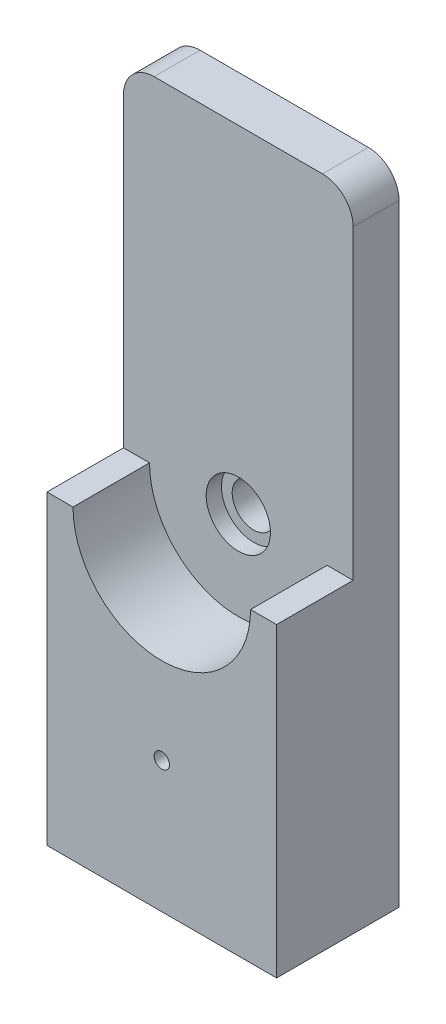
from build123d import *

# Parameters (mm, degrees)
SKETCH1_R           = 7
BOSS_EXTRUDE1_DEPTH = 10
SKETCH1_4_R         = 10.5
BOSS_EXTRUDE2_DEPTH = 15
BOSS_EXTRUDE3_DEPTH = 25
SKETCH6_R           = 2.5
CUT_EXTRUDE1_DEPTH  = 40


with BuildPart() as part:
    # Sketch1 → Boss-Extrude1 (new body)
    with BuildSketch(Plane.XY):
        with BuildLine():
            Line((-27.5, 110), (27.5, 110))
            ThreePointArc((27.5, 110), (34.571067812, 107.071067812), (37.5, 100))
            Line((37.5, 100), (37.5, -100))
            Line((37.5, -100), (-37.5, -100))
            Line((-37.5, -100), (-37.5, 100))
            ThreePointArc((-37.5, 100), (-34.571067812, 107.071067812), (-27.5, 110))
        make_face()
        Circle(SKETCH1_R, mode=Mode.SUBTRACT)
    extrude(amount=BOSS_EXTRUDE1_DEPTH)

    # Sketch1_4 → Boss-Extrude2 (add)
    with BuildSketch(Plane.XY):
        with BuildLine():
            Line((-27.5, 110), (27.5, 110))
            ThreePointArc((27.5, 110), (34.571067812, 107.071067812), (37.5, 100))
            Line((37.5, 100), (37.5, -100))
            Line((37.5, -100), (-37.5, -100))
            Line((-37.5, -100), (-37.5, 100))
            ThreePointArc((-37.5, 100), (-34.571067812, 107.071067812), (-27.5, 110))
        make_face()
        Circle(SKETCH1_4_R, mode=Mode.SUBTRACT)
    extrude(amount=BOSS_EXTRUDE2_DEPTH)

    # Sketch2 → Boss-Extrude3 (add)
    with BuildSketch(Plane.XY.offset(15)):
        with BuildLine():
            Line((-37.5, 0), (-37.5, -100))
            Line((-37.5, -100), (37.5, -100))
            Line((37.5, -100), (37.5, 0))
            Line((37.5, 0), (29, 0))
            ThreePointArc((29, 0), (0, -29), (-29, 0))
            Line((-29, 0), (-37.5, 0))
        make_face()
    extrude(amount=BOSS_EXTRUDE3_DEPTH)

    # Sketch6 → Cut-Extrude1 (cut)
    with BuildSketch(Plane.XY.offset(40)):
        with Locations((0, -57.182340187)):
            Circle(SKETCH6_R)
    extrude(amount=-CUT_EXTRUDE1_DEPTH, mode=Mode.SUBTRACT)


solid = part.part
